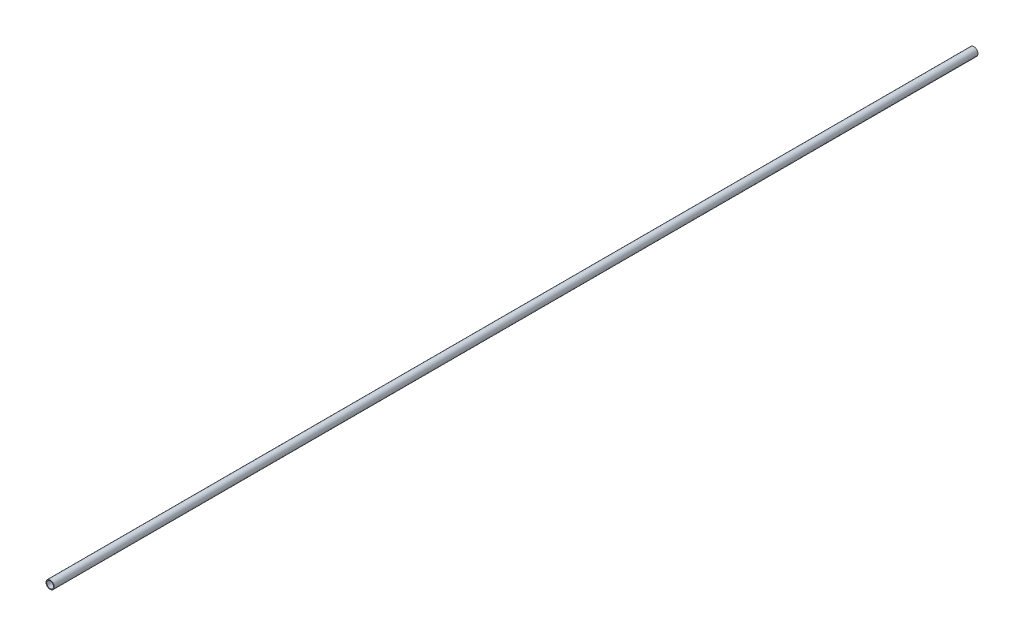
from build123d import *

# Parameters (mm, degrees)
SKETCH1_R           = 6
SKETCH1_R_2         = 5
BOSS_EXTRUDE1_DEPTH = 1350


with BuildPart() as part:
    # Sketch1 → Boss-Extrude1 (new body)
    with BuildSketch(Plane.XY):
        Circle(SKETCH1_R)
        Circle(SKETCH1_R_2, mode=Mode.SUBTRACT)
    extrude(amount=BOSS_EXTRUDE1_DEPTH)


solid = part.part
